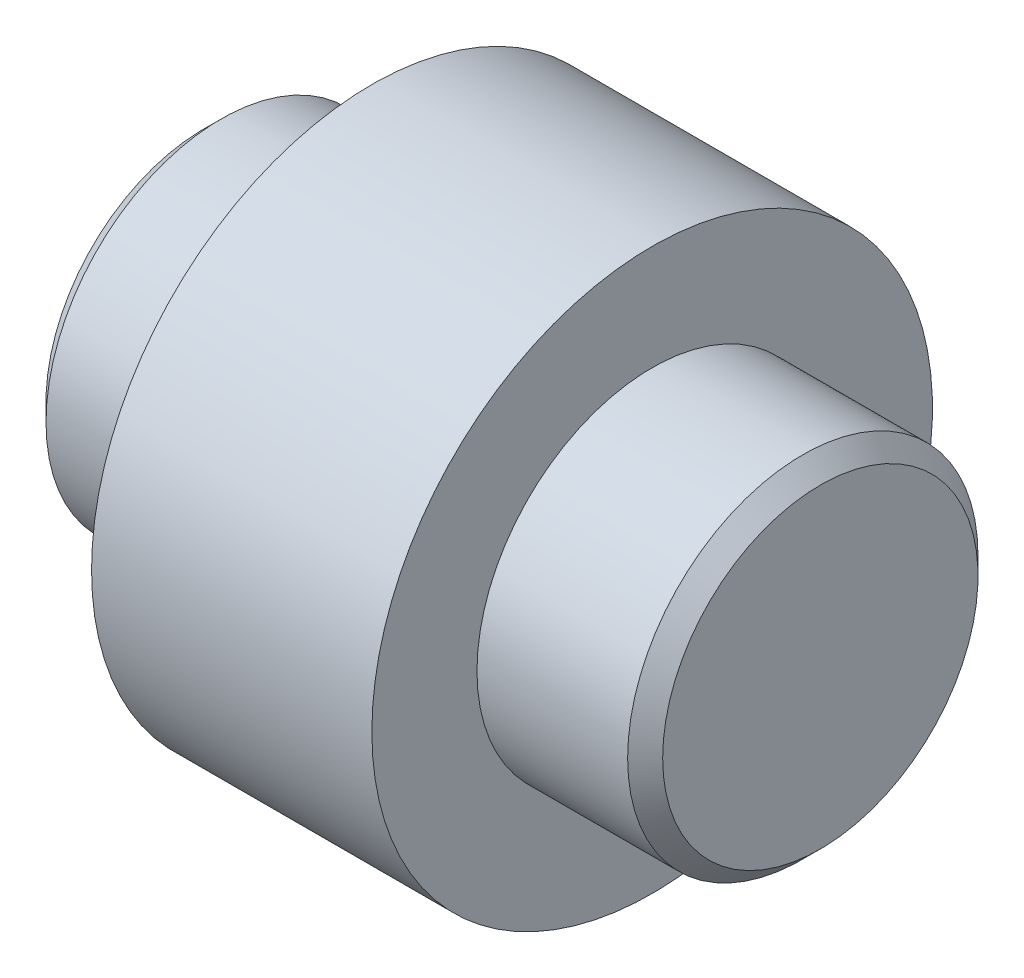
ISO-10303-21;
HEADER;
FILE_DESCRIPTION(('STEP AP214'),'2;1');
FILE_NAME('part.step','',(''),(''),'','','');
FILE_SCHEMA(('AUTOMOTIVE_DESIGN { 1 0 10303 214 1 1 1 1 }'));
ENDSEC;
DATA;
#1=APPLICATION_CONTEXT('core data for automotive mechanical design processes');
#2=APPLICATION_PROTOCOL_DEFINITION('international standard','automotive_design',2000,#1);
#3=PRODUCT_CONTEXT('',#1,'mechanical');
#4=PRODUCT('Part','Part','',(#3));
#5=PRODUCT_RELATED_PRODUCT_CATEGORY('part','',(#4));
#6=PRODUCT_DEFINITION_FORMATION('','',#4);
#7=PRODUCT_DEFINITION_CONTEXT('part definition',#1,'design');
#8=PRODUCT_DEFINITION('design','',#6,#7);
#9=PRODUCT_DEFINITION_SHAPE('','',#8);
#10=(LENGTH_UNIT() NAMED_UNIT(*) SI_UNIT(.MILLI.,.METRE.));
#11=(NAMED_UNIT(*) PLANE_ANGLE_UNIT() SI_UNIT($,.RADIAN.));
#12=(NAMED_UNIT(*) SI_UNIT($,.STERADIAN.) SOLID_ANGLE_UNIT());
#13=UNCERTAINTY_MEASURE_WITH_UNIT(LENGTH_MEASURE(1.E-05),#10,'distance_accuracy_value','');
#14=(GEOMETRIC_REPRESENTATION_CONTEXT(3) GLOBAL_UNCERTAINTY_ASSIGNED_CONTEXT((#13)) GLOBAL_UNIT_ASSIGNED_CONTEXT((#10,
#11,#12)) REPRESENTATION_CONTEXT('',''));
#15=CARTESIAN_POINT('',(0.,0.,0.));
#16=DIRECTION('',(0.,0.,1.));
#17=DIRECTION('',(1.,0.,0.));
#18=AXIS2_PLACEMENT_3D('',#15,#16,#17);
#19=CARTESIAN_POINT('',(0.,0.,0.));
#20=DIRECTION('',(1.,0.,0.));
#21=DIRECTION('',(0.,0.,-1.));
#22=AXIS2_PLACEMENT_3D('',#19,#20,#21);
#23=PLANE('',#22);
#24=CARTESIAN_POINT('',(0.,0.,0.));
#25=DIRECTION('',(1.,0.,0.));
#26=DIRECTION('',(0.,0.,-1.));
#27=AXIS2_PLACEMENT_3D('',#24,#25,#26);
#28=CIRCLE('',#27,2.25);
#29=CARTESIAN_POINT('',(0.,0.,-2.25));
#30=VERTEX_POINT('',#29);
#31=EDGE_CURVE('E45',#30,#30,#28,.F.);
#32=ORIENTED_EDGE('',*,*,#31,.T.);
#33=EDGE_LOOP('',(#32));
#34=FACE_BOUND('',#33,.T.);
#35=ADVANCED_FACE('F30',(#34),#23,.F.);
#36=CARTESIAN_POINT('',(0.,0.,0.));
#37=DIRECTION('',(-1.,0.,0.));
#38=DIRECTION('',(0.,0.,1.));
#39=AXIS2_PLACEMENT_3D('',#36,#37,#38);
#40=CYLINDRICAL_SURFACE('',#39,2.5);
#41=CARTESIAN_POINT('',(0.250000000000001,0.,0.));
#42=DIRECTION('',(1.,0.,0.));
#43=DIRECTION('',(0.,0.,-1.));
#44=AXIS2_PLACEMENT_3D('',#41,#42,#43);
#45=CIRCLE('',#44,2.5);
#46=CARTESIAN_POINT('',(0.250000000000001,0.,-2.5));
#47=VERTEX_POINT('',#46);
#48=EDGE_CURVE('E41',#47,#47,#45,.T.);
#49=ORIENTED_EDGE('',*,*,#48,.T.);
#50=EDGE_LOOP('',(#49));
#51=FACE_BOUND('',#50,.T.);
#52=CARTESIAN_POINT('',(2.4,0.,0.));
#53=DIRECTION('',(-1.,0.,0.));
#54=DIRECTION('',(0.,0.,1.));
#55=AXIS2_PLACEMENT_3D('',#52,#53,#54);
#56=CIRCLE('',#55,2.5);
#57=CARTESIAN_POINT('',(2.4,0.,2.5));
#58=VERTEX_POINT('',#57);
#59=EDGE_CURVE('E50',#58,#58,#56,.T.);
#60=ORIENTED_EDGE('',*,*,#59,.T.);
#61=EDGE_LOOP('',(#60));
#62=FACE_BOUND('',#61,.T.);
#63=ADVANCED_FACE('F79',(#51,#62),#40,.T.);
#64=CARTESIAN_POINT('',(2.4,2.5,0.));
#65=DIRECTION('',(1.,0.,0.));
#66=DIRECTION('',(0.,0.,-1.));
#67=AXIS2_PLACEMENT_3D('',#64,#65,#66);
#68=PLANE('',#67);
#69=ORIENTED_EDGE('',*,*,#59,.F.);
#70=EDGE_LOOP('',(#69));
#71=FACE_BOUND('',#70,.T.);
#72=CARTESIAN_POINT('',(2.4,0.,0.));
#73=DIRECTION('',(-1.,0.,0.));
#74=DIRECTION('',(0.,0.,1.));
#75=AXIS2_PLACEMENT_3D('',#72,#73,#74);
#76=CIRCLE('',#75,4.);
#77=CARTESIAN_POINT('',(2.4,0.,4.));
#78=VERTEX_POINT('',#77);
#79=EDGE_CURVE('E53',#78,#78,#76,.T.);
#80=ORIENTED_EDGE('',*,*,#79,.T.);
#81=EDGE_LOOP('',(#80));
#82=FACE_BOUND('',#81,.T.);
#83=ADVANCED_FACE('F85',(#71,#82),#68,.F.);
#84=CARTESIAN_POINT('',(0.,0.,0.));
#85=DIRECTION('',(-1.,0.,0.));
#86=DIRECTION('',(0.,0.,1.));
#87=AXIS2_PLACEMENT_3D('',#84,#85,#86);
#88=CYLINDRICAL_SURFACE('',#87,4.);
#89=ORIENTED_EDGE('',*,*,#79,.F.);
#90=EDGE_LOOP('',(#89));
#91=FACE_BOUND('',#90,.T.);
#92=CARTESIAN_POINT('',(6.4,0.,0.));
#93=DIRECTION('',(-1.,0.,0.));
#94=DIRECTION('',(0.,0.,1.));
#95=AXIS2_PLACEMENT_3D('',#92,#93,#94);
#96=CIRCLE('',#95,4.);
#97=CARTESIAN_POINT('',(6.4,0.,4.));
#98=VERTEX_POINT('',#97);
#99=EDGE_CURVE('E56',#98,#98,#96,.T.);
#100=ORIENTED_EDGE('',*,*,#99,.T.);
#101=EDGE_LOOP('',(#100));
#102=FACE_BOUND('',#101,.T.);
#103=ADVANCED_FACE('F75',(#91,#102),#88,.T.);
#104=CARTESIAN_POINT('',(6.4,4.,0.));
#105=DIRECTION('',(-1.,0.,0.));
#106=DIRECTION('',(0.,0.,1.));
#107=AXIS2_PLACEMENT_3D('',#104,#105,#106);
#108=PLANE('',#107);
#109=ORIENTED_EDGE('',*,*,#99,.F.);
#110=EDGE_LOOP('',(#109));
#111=FACE_BOUND('',#110,.T.);
#112=CARTESIAN_POINT('',(6.4,0.,0.));
#113=DIRECTION('',(-1.,0.,0.));
#114=DIRECTION('',(0.,0.,1.));
#115=AXIS2_PLACEMENT_3D('',#112,#113,#114);
#116=CIRCLE('',#115,2.5);
#117=CARTESIAN_POINT('',(6.4,0.,2.5));
#118=VERTEX_POINT('',#117);
#119=EDGE_CURVE('E59',#118,#118,#116,.T.);
#120=ORIENTED_EDGE('',*,*,#119,.T.);
#121=EDGE_LOOP('',(#120));
#122=FACE_BOUND('',#121,.T.);
#123=ADVANCED_FACE('F63',(#111,#122),#108,.F.);
#124=CARTESIAN_POINT('',(0.,0.,0.));
#125=DIRECTION('',(-1.,0.,0.));
#126=DIRECTION('',(0.,0.,1.));
#127=AXIS2_PLACEMENT_3D('',#124,#125,#126);
#128=CYLINDRICAL_SURFACE('',#127,2.5);
#129=CARTESIAN_POINT('',(8.55,0.,0.));
#130=DIRECTION('',(-1.,0.,0.));
#131=DIRECTION('',(0.,0.,1.));
#132=AXIS2_PLACEMENT_3D('',#129,#130,#131);
#133=CIRCLE('',#132,2.5);
#134=CARTESIAN_POINT('',(8.55,0.,2.5));
#135=VERTEX_POINT('',#134);
#136=EDGE_CURVE('E37',#135,#135,#133,.T.);
#137=ORIENTED_EDGE('',*,*,#136,.T.);
#138=EDGE_LOOP('',(#137));
#139=FACE_BOUND('',#138,.T.);
#140=ORIENTED_EDGE('',*,*,#119,.F.);
#141=EDGE_LOOP('',(#140));
#142=FACE_BOUND('',#141,.T.);
#143=ADVANCED_FACE('F65',(#139,#142),#128,.T.);
#144=CARTESIAN_POINT('',(8.8,2.5,0.));
#145=DIRECTION('',(-1.,0.,0.));
#146=DIRECTION('',(0.,0.,1.));
#147=AXIS2_PLACEMENT_3D('',#144,#145,#146);
#148=PLANE('',#147);
#149=CARTESIAN_POINT('',(8.8,0.,0.));
#150=DIRECTION('',(-1.,0.,0.));
#151=DIRECTION('',(0.,0.,1.));
#152=AXIS2_PLACEMENT_3D('',#149,#150,#151);
#153=CIRCLE('',#152,2.25);
#154=CARTESIAN_POINT('',(8.8,0.,2.25));
#155=VERTEX_POINT('',#154);
#156=EDGE_CURVE('E10',#155,#155,#153,.F.);
#157=ORIENTED_EDGE('',*,*,#156,.T.);
#158=EDGE_LOOP('',(#157));
#159=FACE_BOUND('',#158,.T.);
#160=ADVANCED_FACE('F67',(#159),#148,.F.);
#161=CARTESIAN_POINT('',(0.,0.,0.));
#162=DIRECTION('',(1.,0.,0.));
#163=DIRECTION('',(0.,0.,-1.));
#164=AXIS2_PLACEMENT_3D('',#161,#162,#163);
#165=CONICAL_SURFACE('',#164,2.25,0.785398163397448);
#166=ORIENTED_EDGE('',*,*,#48,.F.);
#167=EDGE_LOOP('',(#166));
#168=FACE_BOUND('',#167,.T.);
#169=ORIENTED_EDGE('',*,*,#31,.F.);
#170=EDGE_LOOP('',(#169));
#171=FACE_BOUND('',#170,.T.);
#172=ADVANCED_FACE('F73',(#168,#171),#165,.T.);
#173=CARTESIAN_POINT('',(8.55,0.,0.));
#174=DIRECTION('',(-1.,0.,0.));
#175=DIRECTION('',(0.,0.,1.));
#176=AXIS2_PLACEMENT_3D('',#173,#174,#175);
#177=CONICAL_SURFACE('',#176,2.5,0.78539816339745);
#178=ORIENTED_EDGE('',*,*,#156,.F.);
#179=EDGE_LOOP('',(#178));
#180=FACE_BOUND('',#179,.T.);
#181=ORIENTED_EDGE('',*,*,#136,.F.);
#182=EDGE_LOOP('',(#181));
#183=FACE_BOUND('',#182,.T.);
#184=ADVANCED_FACE('F32',(#180,#183),#177,.T.);
#185=CLOSED_SHELL('',(#35,#63,#83,#103,#123,#143,#160,#172,#184));
#186=MANIFOLD_SOLID_BREP('B2',#185);
#187=ADVANCED_BREP_SHAPE_REPRESENTATION('',(#18,#186),#14);
#188=SHAPE_DEFINITION_REPRESENTATION(#9,#187);
ENDSEC;
END-ISO-10303-21;
